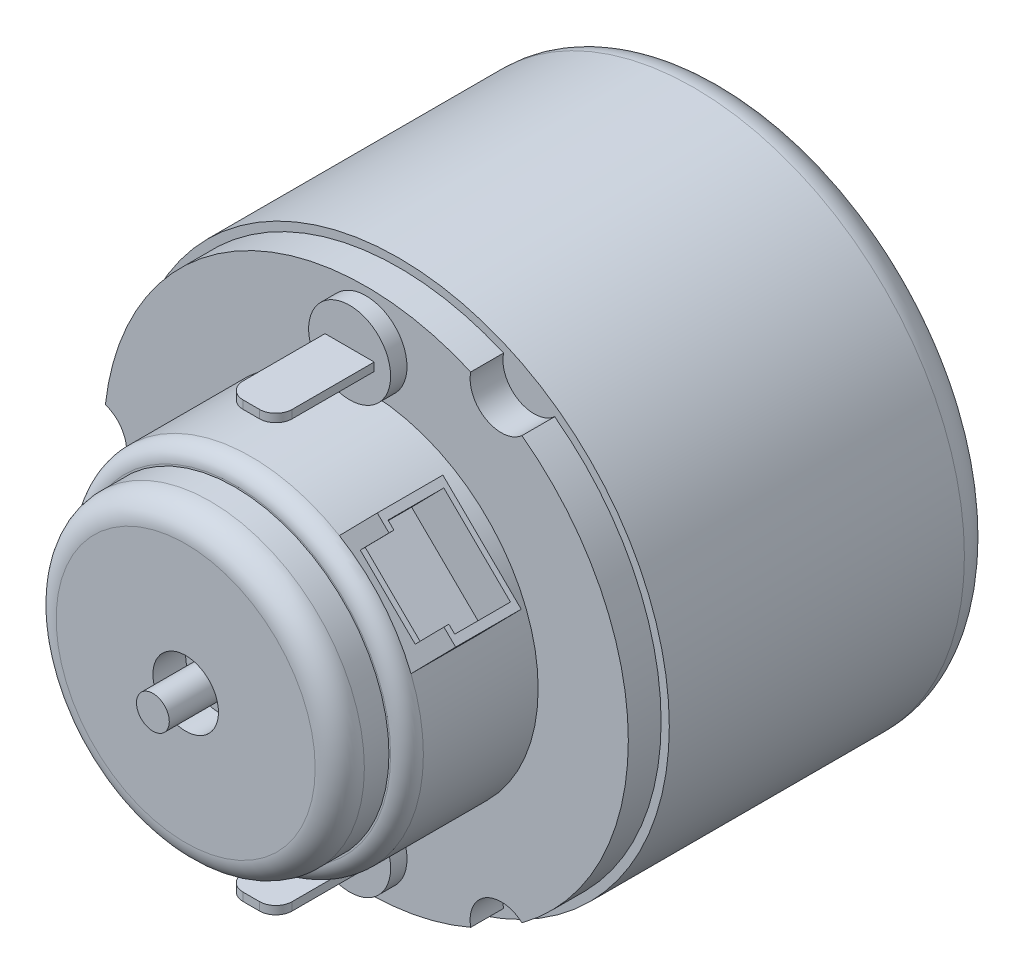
from build123d import *

# Parameters (mm, degrees)
ESBO_O1_R                                  = 16.5
RESSALTO_EXTRUS_O1_DEPTH                   = 20
ESBO_O4_R                                  = 3.5
RESSALTO_EXTRUS_O4_DEPTH                   = 1.5
ESBO_O14_R                                 = 1
RESSALTO_EXTRUS_O7_DEPTH                   = 3.5
FURO_ROSCADO_DE_M2_5X0_451_D               = 2.05
FURO_ROSCADO_DE_M2_5X0_451_DEPTH           = 3.5
FURO_ROSCADO_DE_M2_5X0_451_TIP             = 0.615882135
FILETE1_R                                  = 2
RESSALTO_EXTRUS_O9_DEPTH                   = 2
ESBO_O18_R                                 = 10.5
RESSALTO_EXTRUS_O10_DEPTH                  = 8
FILETE2_R                                  = 1
ESBO_O19_R                                 = 9.4
RESSALTO_EXTRUS_O11_DEPTH                  = 3
FILETE3_R                                  = 1.5
ESBO_O20_R                                 = 2
CORTE_EXTRUS_O1_DEPTH                      = 2
RESSALTO_EXTRUS_O13_START                  = 4
ESBO_O21_R                                 = 1
RESSALTO_EXTRUS_O13_DEPTH                  = 4
ESBO_O22_R                                 = 2.5
RESSALTO_EXTRUS_O15_DEPTH                  = 1
RESSALTO_EXTRUS_O15_2_DEPTH                = 1
ESBO_O23_W                                 = 3
ESBO_O23_H                                 = 0.5
RESSALTO_EXTRUS_O16_DEPTH                  = 6
FILETE4_R                                  = 1
FILETE5_R                                  = 1
ESBO_O24_W                                 = 6.7
ESBO_O24_H                                 = 4
RESSALTO_EXTRUS_O17_DEPTH                  = 3
RESSALTO_EXTRUS_O17_DIRECTION_2_REACH      = 50.68
RESSALTO_EXTRUS_O17_DIRECTION_2_END_RADIUS = 10.5
ESBO_O25_W                                 = 5.7
ESBO_O25_H                                 = 3
ESBO_O25_H_2                               = 0.2
CORTE_EXTRUS_O2_DEPTH                      = 2.8
ESBO_O26_W                                 = 4.7
ESBO_O26_H                                 = 0.3
CORTE_EXTRUS_O3_DEPTH                      = 2.5


with BuildPart() as part:
    # Esbo_o1 → Ressalto-extrus_o1 (new body)
    with BuildSketch(Plane.XY):
        Circle(ESBO_O1_R)
    extrude(amount=RESSALTO_EXTRUS_O1_DEPTH)

    # Esbo_o4 → Ressalto-extrus_o4 (add)
    with BuildSketch(Plane(origin=(0, 0, 0), x_dir=(-1, 0, 0), z_dir=(0, 0, -1))):
        with Locations(Location((0, 0, 0), (0, 0, 180))):
            Circle(ESBO_O4_R)
    extrude(amount=RESSALTO_EXTRUS_O4_DEPTH)

    # Esbo_o14 → Ressalto-extrus_o7 (add)
    with BuildSketch(Plane(origin=(0, 0, -1.5), x_dir=(-1, 0, 0), z_dir=(0, 0, -1))):
        Circle(ESBO_O14_R)
    extrude(amount=RESSALTO_EXTRUS_O7_DEPTH)

    # Furo roscado de M2.5x0.451
    with Locations(Plane(origin=(0, 0, 0), x_dir=(-1, 0, 0), z_dir=(0, 0, -1))):
        with Locations((11.258330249, -6.5), (0, 13), (-11.258330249, -6.5), (11.258330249, 6.5), (0, -13), (-11.258330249, 6.5)):
            Hole(FURO_ROSCADO_DE_M2_5X0_451_D / 2, depth=FURO_ROSCADO_DE_M2_5X0_451_DEPTH)
            with Locations((0, 0, -(FURO_ROSCADO_DE_M2_5X0_451_DEPTH + FURO_ROSCADO_DE_M2_5X0_451_TIP / 2))):  # 118° drill point
                Cone(0, FURO_ROSCADO_DE_M2_5X0_451_D / 2, FURO_ROSCADO_DE_M2_5X0_451_TIP, mode=Mode.SUBTRACT)

    # Filete1
    filete1_edges = [part.edges().sort_by_distance(p)[0] for p in [
        (-16.5, 0, 0),
    ]]
    fillet(filete1_edges, radius=FILETE1_R)

    # Esbo_o17 → Ressalto-extrus_o9 (add)
    with BuildSketch(Plane.XY.offset(20)):
        with BuildLine():
            ThreePointArc((6.388366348, -14.669314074), (7.3, -12.643970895), (9.509815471, -12.867144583))
            ThreePointArc((9.509815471, -12.867144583), (16, 0), (9.509815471, 12.867144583))
            ThreePointArc((9.509815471, 12.867144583), (7.3, 12.643970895), (6.388366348, 14.669314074))
            ThreePointArc((6.388366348, 14.669314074), (-8, 13.856406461), (-15.898181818, 1.802169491))
            ThreePointArc((-15.898181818, 1.802169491), (-14.6, 0), (-15.898181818, -1.802169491))
            ThreePointArc((-15.898181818, -1.802169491), (-8, -13.856406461), (6.388366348, -14.669314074))
        make_face()
    extrude(amount=RESSALTO_EXTRUS_O9_DEPTH)

    # Esbo_o18 → Ressalto-extrus_o10 (add)
    with BuildSketch(Plane.XY.offset(22)):
        Circle(ESBO_O18_R)
    extrude(amount=RESSALTO_EXTRUS_O10_DEPTH)

    # Filete2
    filete2_edges = [part.edges().sort_by_distance(p)[0] for p in [
        (-10.5, 0, 30),
    ]]
    fillet(filete2_edges, radius=FILETE2_R)

    # Esbo_o19 → Ressalto-extrus_o11 (add)
    with BuildSketch(Plane.XY.offset(30)):
        Circle(ESBO_O19_R)
    extrude(amount=RESSALTO_EXTRUS_O11_DEPTH)

    # Filete3
    filete3_edges = [part.edges().sort_by_distance(p)[0] for p in [
        (-9.4, 0, 33),
    ]]
    fillet(filete3_edges, radius=FILETE3_R)

    # Esbo_o20 → Corte-extrus_o1 (cut)
    with BuildSketch(Plane.XY.offset(33)):
        Circle(ESBO_O20_R)
    extrude(amount=-CORTE_EXTRUS_O1_DEPTH, mode=Mode.SUBTRACT)

    # Esbo_o21 → Ressalto-extrus_o13 (add)
    with BuildSketch(Plane.XY.offset(31).offset(RESSALTO_EXTRUS_O13_START)):
        with Locations(Location((0, 0, 0), (0, 0, 180))):
            Circle(ESBO_O21_R)
    extrude(amount=-RESSALTO_EXTRUS_O13_DEPTH)

    # Esbo_o24 → Ressalto-extrus_o17 (add)
    with BuildSketch(Plane(origin=(7.361307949, 7.4873991, 0), x_dir=(-0.7130856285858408, 0.7010769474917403, 0), z_dir=(0.7010769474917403, 0.7130856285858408, 0))):
        with Locations((-0.859017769, 27)):
            Rectangle(ESBO_O24_W, ESBO_O24_H)
    extrude(amount=RESSALTO_EXTRUS_O17_DEPTH)

    # Ressalto-extrus_o17 direction 2: up to this cylinder (the profile starts outside it)
    ressalto_extrus_o17_direction_2_end = Plane(origin=(0, 0, 27), z_dir=(0, 0, -1)) * Cylinder(RESSALTO_EXTRUS_O17_DIRECTION_2_END_RADIUS, 123.36, mode=Mode.PRIVATE)
    # Esbo_o24 → Ressalto-extrus_o17 direction 2 (add, up to the surface)
    with BuildSketch(Plane(origin=(7.361307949, 7.4873991, 0), x_dir=(-0.7130856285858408, 0.7010769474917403, 0), z_dir=(0.7010769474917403, 0.7130856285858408, 0)), mode=Mode.PRIVATE) as ressalto_extrus_o17_direction_2_sk1:
        with Locations((-0.859017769, 27)):
            Rectangle(ESBO_O24_W, ESBO_O24_H)
    ressalto_extrus_o17_direction_2_tool1 = extrude(ressalto_extrus_o17_direction_2_sk1.sketch, amount=-RESSALTO_EXTRUS_O17_DIRECTION_2_REACH, mode=Mode.PRIVATE) - ressalto_extrus_o17_direction_2_end
    add(ressalto_extrus_o17_direction_2_tool1.solids().sort_by_distance((7.973861, 6.885162, 27))[0])
    add(ressalto_extrus_o17_direction_2_tool1.solids().sort_by_distance((7.973861, 6.885162, 27))[1])

    # Esbo_o25 → Corte-extrus_o2 (cut)
    with BuildSketch(Plane(origin=(9.464538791, 9.626655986, 0), x_dir=(0.7130856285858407, -0.7010769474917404, 0), z_dir=(0.7010769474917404, 0.7130856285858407, 0))):
        with Locations((0.859017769, -27)):
            Rectangle(ESBO_O25_W, ESBO_O25_H)
        with Locations((0.859017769, -28.6)):
            Rectangle(ESBO_O25_W, ESBO_O25_H_2)
        with Locations((0.859017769, -25.4)):
            Rectangle(ESBO_O25_W, ESBO_O25_H_2)
    extrude(amount=-CORTE_EXTRUS_O2_DEPTH, mode=Mode.SUBTRACT)

    # Esbo_o26 → Corte-extrus_o3 (cut)
    with BuildSketch(Plane(origin=(9.464538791, 9.626655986, 0), x_dir=(0.7130856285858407, -0.7010769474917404, 0), z_dir=(0.7010769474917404, 0.7130856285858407, 0))):
        with Locations((0.859017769, -28.85)):
            Rectangle(ESBO_O26_W, ESBO_O26_H)
    extrude(amount=-CORTE_EXTRUS_O3_DEPTH, mode=Mode.SUBTRACT)


with BuildPart() as body_2:
    # Esbo_o22 → Ressalto-extrus_o15 (new body)
    with BuildSketch(Plane.XY.offset(22)):
        with Locations((0, 13)):
            Circle(ESBO_O22_R)
    extrude(amount=RESSALTO_EXTRUS_O15_DEPTH)



with BuildPart() as body_3:
    # Esbo_o22 → Ressalto-extrus_o15 2 (new body)
    with BuildSketch(Plane.XY.offset(22)):
        with Locations((0, -13)):
            Circle(ESBO_O22_R)
    extrude(amount=RESSALTO_EXTRUS_O15_2_DEPTH)


with BuildPart() as body_2_1:
    add(body_2.part)

    add(body_3.part)  # Ressalto-extrus_o16 merges body 3
    # Esbo_o23 → Ressalto-extrus_o16 (add)
    with BuildSketch(Plane.XY.offset(23)):
        with Locations((0, -13)):
            Rectangle(ESBO_O23_W, ESBO_O23_H)
        with Locations((0, 13)):
            Rectangle(ESBO_O23_W, ESBO_O23_H)
    extrude(amount=RESSALTO_EXTRUS_O16_DEPTH)

    # Filete4
    filete4_edges = [body_2_1.edges().sort_by_distance(p)[0] for p in [
        (-1.5, -13, 29),
        (1.5, -13, 29),
    ]]
    fillet(filete4_edges, radius=FILETE4_R)

    # Filete5
    filete5_edges = [body_2_1.edges().sort_by_distance(p)[0] for p in [
        (-1.5, 13, 29),
        (1.5, 13, 29),
    ]]
    fillet(filete5_edges, radius=FILETE5_R)


solid = Compound([part.part, body_2_1.part])
